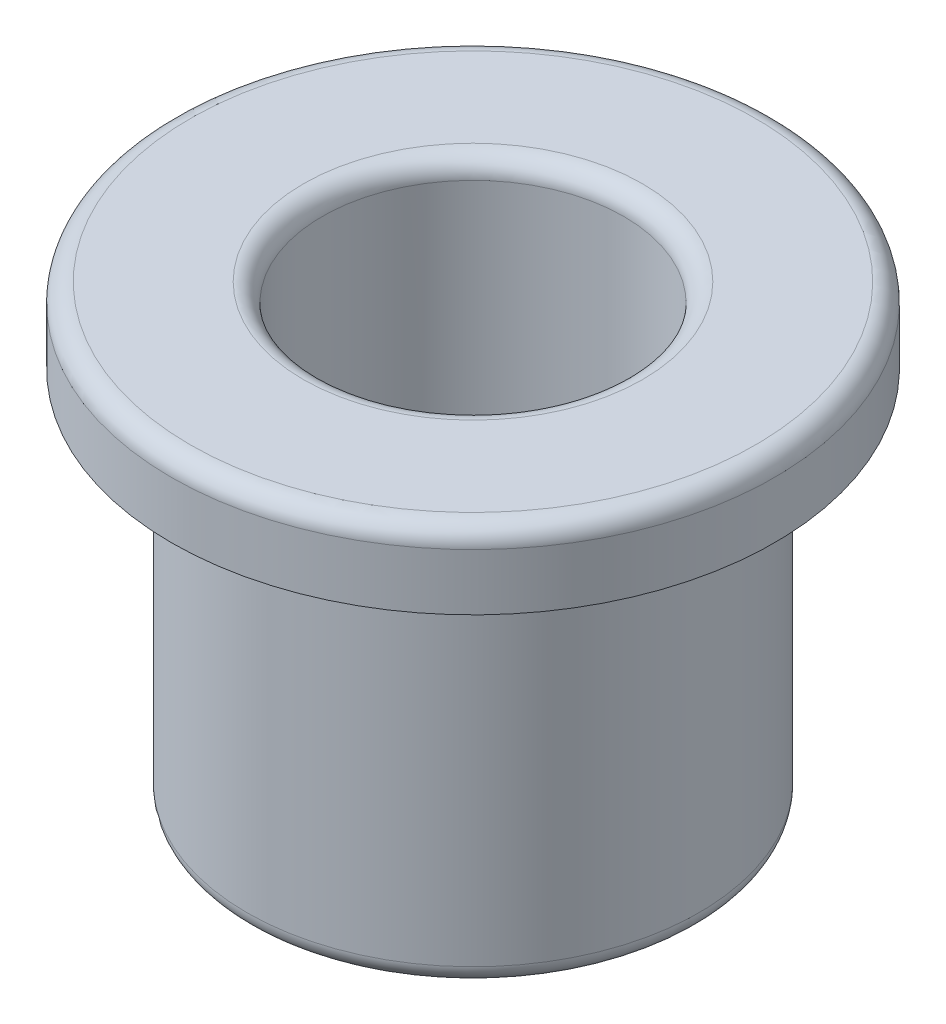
from build123d import *

# Parameters (mm, degrees)
CONG_1_R = 0.5


with BuildPart() as part:
    # Esquisse1 → R_volution1 (revolve)
    with BuildSketch(Plane.XY, mode=Mode.PRIVATE) as r_volution1_sk:
        Polygon((4, 0), (6, 0), (6, 10), (8, 10), (8, 12), (4, 12), align=None)
    revolve(r_volution1_sk.sketch.rotate(Axis((0, 0, 0), (0, 1, 0)), 90), axis=Axis((0, 0, 0), (0, 1, 0)))

    # Cong_1
    cong_1_edges = [part.edges().sort_by_distance(p)[0] for p in [
        (0, 0, 4),
        (0, 0, 6),
        (0, 10, 6),
        (0, 12, 8),
        (0, 12, 4),
    ]]
    fillet(cong_1_edges, radius=CONG_1_R)


solid = part.part
